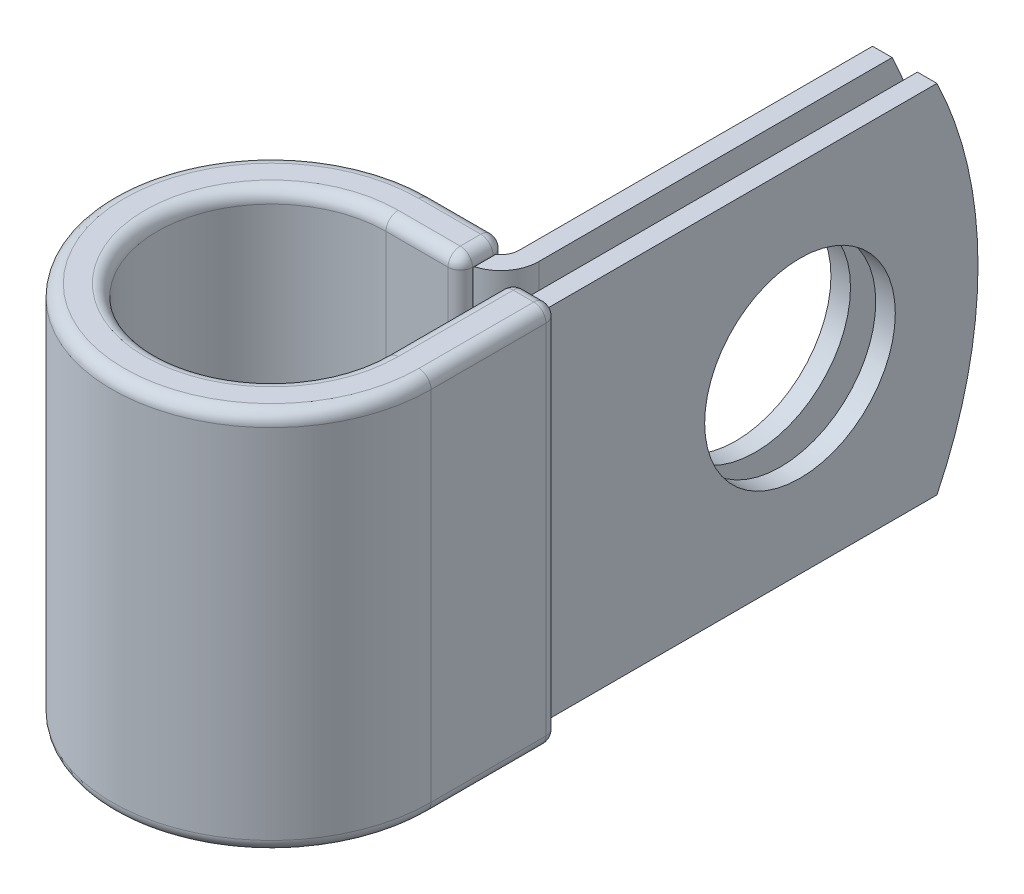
ISO-10303-21;
HEADER;
FILE_DESCRIPTION(('STEP AP214'),'2;1');
FILE_NAME('part.step','',(''),(''),'','','');
FILE_SCHEMA(('AUTOMOTIVE_DESIGN { 1 0 10303 214 1 1 1 1 }'));
ENDSEC;
DATA;
#1=APPLICATION_CONTEXT('core data for automotive mechanical design processes');
#2=APPLICATION_PROTOCOL_DEFINITION('international standard','automotive_design',2000,#1);
#3=PRODUCT_CONTEXT('',#1,'mechanical');
#4=PRODUCT('Part','Part','',(#3));
#5=PRODUCT_RELATED_PRODUCT_CATEGORY('part','',(#4));
#6=PRODUCT_DEFINITION_FORMATION('','',#4);
#7=PRODUCT_DEFINITION_CONTEXT('part definition',#1,'design');
#8=PRODUCT_DEFINITION('design','',#6,#7);
#9=PRODUCT_DEFINITION_SHAPE('','',#8);
#10=(LENGTH_UNIT() NAMED_UNIT(*) SI_UNIT(.MILLI.,.METRE.));
#11=(NAMED_UNIT(*) PLANE_ANGLE_UNIT() SI_UNIT($,.RADIAN.));
#12=(NAMED_UNIT(*) SI_UNIT($,.STERADIAN.) SOLID_ANGLE_UNIT());
#13=UNCERTAINTY_MEASURE_WITH_UNIT(LENGTH_MEASURE(1.E-05),#10,'distance_accuracy_value','');
#14=(GEOMETRIC_REPRESENTATION_CONTEXT(3) GLOBAL_UNCERTAINTY_ASSIGNED_CONTEXT((#13)) GLOBAL_UNIT_ASSIGNED_CONTEXT((#10,
#11,#12)) REPRESENTATION_CONTEXT('',''));
#15=CARTESIAN_POINT('',(0.,0.,0.));
#16=DIRECTION('',(0.,0.,1.));
#17=DIRECTION('',(1.,0.,0.));
#18=AXIS2_PLACEMENT_3D('',#15,#16,#17);
#19=CARTESIAN_POINT('',(6.35635,11.1125,-34.8996));
#20=DIRECTION('',(1.,0.,0.));
#21=DIRECTION('',(0.,0.,-1.));
#22=AXIS2_PLACEMENT_3D('',#19,#20,#21);
#23=PLANE('',#22);
#24=CARTESIAN_POINT('',(6.35635,0.,-23.7998));
#25=DIRECTION('',(1.,0.,0.));
#26=DIRECTION('',(0.,0.,-1.));
#27=AXIS2_PLACEMENT_3D('',#24,#25,#26);
#28=CIRCLE('',#27,5.9436);
#29=CARTESIAN_POINT('',(6.35635,0.,-29.7434));
#30=VERTEX_POINT('',#29);
#31=EDGE_CURVE('E410',#30,#30,#28,.F.);
#32=ORIENTED_EDGE('',*,*,#31,.T.);
#33=EDGE_LOOP('',(#32));
#34=FACE_BOUND('',#33,.T.);
#35=DIRECTION('',(0.,0.,1.));
#36=VECTOR('',#35,1.);
#37=CARTESIAN_POINT('',(6.35635,-11.1125,-34.8996));
#38=LINE('',#37,#36);
#39=CARTESIAN_POINT('',(6.35635,-11.1125,-32.3397476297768));
#40=VERTEX_POINT('',#39);
#41=CARTESIAN_POINT('',(6.35635,-11.1125,-10.30859));
#42=VERTEX_POINT('',#41);
#43=EDGE_CURVE('E432',#40,#42,#38,.T.);
#44=ORIENTED_EDGE('',*,*,#43,.F.);
#45=CARTESIAN_POINT('',(6.35635,0.,-9.49960000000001));
#46=DIRECTION('',(1.,0.,0.));
#47=DIRECTION('',(0.,0.,-1.));
#48=AXIS2_PLACEMENT_3D('',#45,#46,#47);
#49=CIRCLE('',#48,25.4);
#50=CARTESIAN_POINT('',(6.35635,11.1125,-32.3397476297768));
#51=VERTEX_POINT('',#50);
#52=EDGE_CURVE('E395',#40,#51,#49,.T.);
#53=ORIENTED_EDGE('',*,*,#52,.T.);
#54=DIRECTION('',(0.,0.,1.));
#55=VECTOR('',#54,1.);
#56=CARTESIAN_POINT('',(6.35635,11.1125,-34.8996));
#57=LINE('',#56,#55);
#58=CARTESIAN_POINT('',(6.35635,11.1125,-10.30859));
#59=VERTEX_POINT('',#58);
#60=EDGE_CURVE('E422',#51,#59,#57,.T.);
#61=ORIENTED_EDGE('',*,*,#60,.T.);
#62=DIRECTION('',(0.,-1.,0.));
#63=VECTOR('',#62,1.);
#64=CARTESIAN_POINT('',(6.35635,11.1125,-10.30859));
#65=LINE('',#64,#63);
#66=EDGE_CURVE('E439',#59,#42,#65,.T.);
#67=ORIENTED_EDGE('',*,*,#66,.T.);
#68=EDGE_LOOP('',(#44,#53,#61,#67));
#69=FACE_BOUND('',#68,.T.);
#70=ADVANCED_FACE('F54',(#34,#69),#23,.T.);
#71=CARTESIAN_POINT('',(5.13715,11.1125,-34.8996));
#72=DIRECTION('',(1.,0.,0.));
#73=DIRECTION('',(0.,0.,-1.));
#74=AXIS2_PLACEMENT_3D('',#71,#72,#73);
#75=PLANE('',#74);
#76=CARTESIAN_POINT('',(5.13715,0.,-23.7998));
#77=DIRECTION('',(-1.,0.,0.));
#78=DIRECTION('',(0.,0.,1.));
#79=AXIS2_PLACEMENT_3D('',#76,#77,#78);
#80=CIRCLE('',#79,5.9436);
#81=CARTESIAN_POINT('',(5.13715,0.,-17.8562));
#82=VERTEX_POINT('',#81);
#83=EDGE_CURVE('E407',#82,#82,#80,.T.);
#84=ORIENTED_EDGE('',*,*,#83,.F.);
#85=EDGE_LOOP('',(#84));
#86=FACE_BOUND('',#85,.T.);
#87=CARTESIAN_POINT('',(5.13715000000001,0.,-9.49960000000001));
#88=DIRECTION('',(-1.,0.,0.));
#89=DIRECTION('',(0.,0.,1.));
#90=AXIS2_PLACEMENT_3D('',#87,#88,#89);
#91=CIRCLE('',#90,25.4);
#92=CARTESIAN_POINT('',(5.13715,11.1125,-32.3397476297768));
#93=VERTEX_POINT('',#92);
#94=CARTESIAN_POINT('',(5.13715000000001,-11.1125,-32.3397476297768));
#95=VERTEX_POINT('',#94);
#96=EDGE_CURVE('E387',#93,#95,#91,.T.);
#97=ORIENTED_EDGE('',*,*,#96,.T.);
#98=DIRECTION('',(0.,0.,1.));
#99=VECTOR('',#98,1.);
#100=CARTESIAN_POINT('',(5.13715,-11.1125,-34.8996));
#101=LINE('',#100,#99);
#102=CARTESIAN_POINT('',(5.13715,-11.1125,-10.30859));
#103=VERTEX_POINT('',#102);
#104=EDGE_CURVE('E434',#95,#103,#101,.T.);
#105=ORIENTED_EDGE('',*,*,#104,.T.);
#106=DIRECTION('',(0.,-1.,0.));
#107=VECTOR('',#106,1.);
#108=CARTESIAN_POINT('',(5.13715,11.1125,-10.30859));
#109=LINE('',#108,#107);
#110=CARTESIAN_POINT('',(5.13715,11.1125,-10.30859));
#111=VERTEX_POINT('',#110);
#112=EDGE_CURVE('E427',#111,#103,#109,.T.);
#113=ORIENTED_EDGE('',*,*,#112,.F.);
#114=DIRECTION('',(0.,0.,1.));
#115=VECTOR('',#114,1.);
#116=CARTESIAN_POINT('',(5.13715,11.1125,-34.8996));
#117=LINE('',#116,#115);
#118=EDGE_CURVE('E424',#93,#111,#117,.T.);
#119=ORIENTED_EDGE('',*,*,#118,.F.);
#120=EDGE_LOOP('',(#97,#105,#113,#119));
#121=FACE_BOUND('',#120,.T.);
#122=ADVANCED_FACE('F738',(#86,#121),#75,.F.);
#123=CARTESIAN_POINT('',(0.,-11.1125,0.));
#124=DIRECTION('',(0.,1.,0.));
#125=DIRECTION('',(1.,0.,0.));
#126=AXIS2_PLACEMENT_3D('',#123,#124,#125);
#127=PLANE('',#126);
#128=CARTESIAN_POINT('',(3.97891,-11.1125,-10.30859));
#129=DIRECTION('',(0.,-1.,0.));
#130=DIRECTION('',(0.,0.,1.));
#131=AXIS2_PLACEMENT_3D('',#128,#129,#130);
#132=CIRCLE('',#131,2.37744);
#133=CARTESIAN_POINT('',(4.62915000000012,-11.1125,-8.02179991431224));
#134=VERTEX_POINT('',#133);
#135=EDGE_CURVE('E429',#42,#134,#132,.T.);
#136=ORIENTED_EDGE('',*,*,#135,.T.);
#137=DIRECTION('',(0.,0.,-1.));
#138=VECTOR('',#137,1.);
#139=CARTESIAN_POINT('',(4.62915000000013,-11.1125,-9.15035000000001));
#140=LINE('',#139,#138);
#141=CARTESIAN_POINT('',(4.62915000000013,-11.1125,-9.18209999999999));
#142=VERTEX_POINT('',#141);
#143=EDGE_CURVE('E344',#134,#142,#140,.T.);
#144=ORIENTED_EDGE('',*,*,#143,.T.);
#145=CARTESIAN_POINT('',(3.86715000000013,-11.1125,-9.1821));
#146=DIRECTION('',(0.,1.,0.));
#147=DIRECTION('',(0.,0.,1.));
#148=AXIS2_PLACEMENT_3D('',#145,#146,#147);
#149=CIRCLE('',#148,0.762);
#150=CARTESIAN_POINT('',(4.61278082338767,-11.1125,-9.33919447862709));
#151=VERTEX_POINT('',#150);
#152=EDGE_CURVE('E504',#142,#151,#149,.T.);
#153=ORIENTED_EDGE('',*,*,#152,.T.);
#154=CARTESIAN_POINT('',(3.97891,-11.1125,-10.30859));
#155=DIRECTION('',(0.,1.,0.));
#156=DIRECTION('',(1.,0.,0.));
#157=AXIS2_PLACEMENT_3D('',#154,#155,#156);
#158=CIRCLE('',#157,1.15824);
#159=EDGE_CURVE('E77',#103,#151,#158,.F.);
#160=ORIENTED_EDGE('',*,*,#159,.F.);
#161=ORIENTED_EDGE('',*,*,#104,.F.);
#162=DIRECTION('',(-1.,0.,0.));
#163=VECTOR('',#162,1.);
#164=CARTESIAN_POINT('',(9.15035,-11.1125,-32.3397476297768));
#165=LINE('',#164,#163);
#166=EDGE_CURVE('E448',#40,#95,#165,.T.);
#167=ORIENTED_EDGE('',*,*,#166,.F.);
#168=ORIENTED_EDGE('',*,*,#43,.T.);
#169=EDGE_LOOP('',(#136,#144,#153,#160,#161,#167,#168));
#170=FACE_BOUND('',#169,.T.);
#171=ADVANCED_FACE('F744',(#170),#127,.F.);
#172=CARTESIAN_POINT('',(0.,11.1125,0.));
#173=DIRECTION('',(0.,1.,0.));
#174=DIRECTION('',(1.,0.,0.));
#175=AXIS2_PLACEMENT_3D('',#172,#173,#174);
#176=PLANE('',#175);
#177=DIRECTION('',(0.,0.,-1.));
#178=VECTOR('',#177,1.);
#179=CARTESIAN_POINT('',(4.62915,11.1125,0.));
#180=LINE('',#179,#178);
#181=CARTESIAN_POINT('',(4.62915000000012,11.1125,-8.02179991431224));
#182=VERTEX_POINT('',#181);
#183=CARTESIAN_POINT('',(4.62915000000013,11.1125,-9.18209999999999));
#184=VERTEX_POINT('',#183);
#185=EDGE_CURVE('E381',#182,#184,#180,.T.);
#186=ORIENTED_EDGE('',*,*,#185,.F.);
#187=CARTESIAN_POINT('',(3.97891,11.1125,-10.30859));
#188=DIRECTION('',(0.,-1.,0.));
#189=DIRECTION('',(0.,0.,1.));
#190=AXIS2_PLACEMENT_3D('',#187,#188,#189);
#191=CIRCLE('',#190,2.37744);
#192=EDGE_CURVE('E419',#59,#182,#191,.T.);
#193=ORIENTED_EDGE('',*,*,#192,.F.);
#194=ORIENTED_EDGE('',*,*,#60,.F.);
#195=DIRECTION('',(-1.,0.,0.));
#196=VECTOR('',#195,1.);
#197=CARTESIAN_POINT('',(9.15035,11.1125,-32.3397476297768));
#198=LINE('',#197,#196);
#199=EDGE_CURVE('E445',#51,#93,#198,.T.);
#200=ORIENTED_EDGE('',*,*,#199,.T.);
#201=ORIENTED_EDGE('',*,*,#118,.T.);
#202=CARTESIAN_POINT('',(3.97891,11.1125,-10.30859));
#203=DIRECTION('',(0.,1.,0.));
#204=DIRECTION('',(1.,0.,0.));
#205=AXIS2_PLACEMENT_3D('',#202,#203,#204);
#206=CIRCLE('',#205,1.15824);
#207=CARTESIAN_POINT('',(4.61278082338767,11.1125,-9.33919447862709));
#208=VERTEX_POINT('',#207);
#209=EDGE_CURVE('E70',#111,#208,#206,.F.);
#210=ORIENTED_EDGE('',*,*,#209,.T.);
#211=CARTESIAN_POINT('',(3.86715000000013,11.1125,-9.1821));
#212=DIRECTION('',(0.,1.,0.));
#213=DIRECTION('',(0.,0.,1.));
#214=AXIS2_PLACEMENT_3D('',#211,#212,#213);
#215=CIRCLE('',#214,0.762);
#216=EDGE_CURVE('E12',#208,#184,#215,.F.);
#217=ORIENTED_EDGE('',*,*,#216,.T.);
#218=EDGE_LOOP('',(#186,#193,#194,#200,#201,#210,#217));
#219=FACE_BOUND('',#218,.T.);
#220=ADVANCED_FACE('F752',(#219),#176,.T.);
#221=CARTESIAN_POINT('',(3.97891,11.1125,-10.30859));
#222=DIRECTION('',(0.,-1.,0.));
#223=DIRECTION('',(0.,0.,-1.));
#224=AXIS2_PLACEMENT_3D('',#221,#222,#223);
#225=CYLINDRICAL_SURFACE('',#224,2.37744);
#226=ORIENTED_EDGE('',*,*,#135,.F.);
#227=ORIENTED_EDGE('',*,*,#66,.F.);
#228=ORIENTED_EDGE('',*,*,#192,.T.);
#229=CARTESIAN_POINT('',(3.97891,11.1125,-10.30859));
#230=DIRECTION('',(0.,-1.,0.));
#231=DIRECTION('',(0.,0.,-1.));
#232=AXIS2_PLACEMENT_3D('',#229,#230,#231);
#233=CIRCLE('',#232,2.37744);
#234=CARTESIAN_POINT('',(3.97891,11.1125,-7.93115));
#235=VERTEX_POINT('',#234);
#236=EDGE_CURVE('E378',#235,#182,#233,.F.);
#237=ORIENTED_EDGE('',*,*,#236,.F.);
#238=DIRECTION('',(0.,-1.,0.));
#239=VECTOR('',#238,1.);
#240=CARTESIAN_POINT('',(3.97891,11.1125,-7.93115));
#241=LINE('',#240,#239);
#242=CARTESIAN_POINT('',(3.97891,-11.1125,-7.93115));
#243=VERTEX_POINT('',#242);
#244=EDGE_CURVE('E442',#235,#243,#241,.T.);
#245=ORIENTED_EDGE('',*,*,#244,.T.);
#246=CARTESIAN_POINT('',(3.97891,-11.1125,-10.30859));
#247=DIRECTION('',(0.,1.,0.));
#248=DIRECTION('',(0.,0.,1.));
#249=AXIS2_PLACEMENT_3D('',#246,#247,#248);
#250=CIRCLE('',#249,2.37744);
#251=EDGE_CURVE('E376',#134,#243,#250,.F.);
#252=ORIENTED_EDGE('',*,*,#251,.F.);
#253=EDGE_LOOP('',(#226,#227,#228,#237,#245,#252));
#254=FACE_BOUND('',#253,.T.);
#255=ADVANCED_FACE('F749',(#254),#225,.T.);
#256=CARTESIAN_POINT('',(3.97891,11.1125,-10.30859));
#257=DIRECTION('',(0.,-1.,0.));
#258=DIRECTION('',(0.,0.,-1.));
#259=AXIS2_PLACEMENT_3D('',#256,#257,#258);
#260=CYLINDRICAL_SURFACE('',#259,1.15824);
#261=ORIENTED_EDGE('',*,*,#159,.T.);
#262=DIRECTION('',(0.,1.,0.));
#263=VECTOR('',#262,1.);
#264=CARTESIAN_POINT('',(4.61278082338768,-11.1125,-9.33919447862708));
#265=LINE('',#264,#263);
#266=EDGE_CURVE('E63',#151,#208,#265,.T.);
#267=ORIENTED_EDGE('',*,*,#266,.T.);
#268=ORIENTED_EDGE('',*,*,#209,.F.);
#269=ORIENTED_EDGE('',*,*,#112,.T.);
#270=EDGE_LOOP('',(#261,#267,#268,#269));
#271=FACE_BOUND('',#270,.T.);
#272=ADVANCED_FACE('F751',(#271),#260,.F.);
#273=CARTESIAN_POINT('',(23.1673894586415,0.,-23.7998));
#274=DIRECTION('',(-1.,0.,0.));
#275=DIRECTION('',(0.,0.,1.));
#276=AXIS2_PLACEMENT_3D('',#273,#274,#275);
#277=CYLINDRICAL_SURFACE('',#276,5.9436);
#278=ORIENTED_EDGE('',*,*,#83,.T.);
#279=EDGE_LOOP('',(#278));
#280=FACE_BOUND('',#279,.T.);
#281=ORIENTED_EDGE('',*,*,#31,.F.);
#282=EDGE_LOOP('',(#281));
#283=FACE_BOUND('',#282,.T.);
#284=ADVANCED_FACE('F758',(#280,#283),#277,.F.);
#285=CARTESIAN_POINT('',(9.15035,0.,-9.49960000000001));
#286=DIRECTION('',(-1.,0.,0.));
#287=DIRECTION('',(0.,0.,1.));
#288=AXIS2_PLACEMENT_3D('',#285,#286,#287);
#289=CYLINDRICAL_SURFACE('',#288,25.4);
#290=ORIENTED_EDGE('',*,*,#52,.F.);
#291=ORIENTED_EDGE('',*,*,#166,.T.);
#292=ORIENTED_EDGE('',*,*,#96,.F.);
#293=ORIENTED_EDGE('',*,*,#199,.F.);
#294=EDGE_LOOP('',(#290,#291,#292,#293));
#295=FACE_BOUND('',#294,.T.);
#296=ADVANCED_FACE('F809',(#295),#289,.T.);
#297=CARTESIAN_POINT('',(1.14720938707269E-13,-11.1125,-7.93115));
#298=DIRECTION('',(0.,0.,1.));
#299=DIRECTION('',(1.,0.,0.));
#300=AXIS2_PLACEMENT_3D('',#297,#298,#299);
#301=PLANE('',#300);
#302=DIRECTION('',(1.,0.,0.));
#303=VECTOR('',#302,1.);
#304=CARTESIAN_POINT('',(1.14720938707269E-13,-11.1125,-7.93115));
#305=LINE('',#304,#303);
#306=CARTESIAN_POINT('',(4.62915000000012,-11.1125,-7.93115));
#307=VERTEX_POINT('',#306);
#308=EDGE_CURVE('E351',#243,#307,#305,.T.);
#309=ORIENTED_EDGE('',*,*,#308,.F.);
#310=ORIENTED_EDGE('',*,*,#244,.F.);
#311=DIRECTION('',(1.,0.,0.));
#312=VECTOR('',#311,1.);
#313=CARTESIAN_POINT('',(1.14720938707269E-13,11.1125,-7.93115));
#314=LINE('',#313,#312);
#315=CARTESIAN_POINT('',(4.62915000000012,11.1125,-7.93115));
#316=VERTEX_POINT('',#315);
#317=EDGE_CURVE('E353',#235,#316,#314,.T.);
#318=ORIENTED_EDGE('',*,*,#317,.T.);
#319=DIRECTION('',(0.,-1.,0.));
#320=VECTOR('',#319,1.);
#321=CARTESIAN_POINT('',(4.62915000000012,-11.1125,-7.93115));
#322=LINE('',#321,#320);
#323=EDGE_CURVE('E283',#316,#307,#322,.T.);
#324=ORIENTED_EDGE('',*,*,#323,.T.);
#325=EDGE_LOOP('',(#309,#310,#318,#324));
#326=FACE_BOUND('',#325,.T.);
#327=ADVANCED_FACE('F781',(#326),#301,.F.);
#328=CARTESIAN_POINT('',(4.62915000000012,-11.14425,-7.8994));
#329=DIRECTION('',(1.,0.,0.));
#330=DIRECTION('',(0.,0.,-1.));
#331=AXIS2_PLACEMENT_3D('',#328,#329,#330);
#332=PLANE('',#331);
#333=DIRECTION('',(0.,0.,-1.));
#334=VECTOR('',#333,1.);
#335=CARTESIAN_POINT('',(4.62915000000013,-11.14425,-9.1821));
#336=LINE('',#335,#334);
#337=CARTESIAN_POINT('',(4.62915000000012,-11.14425,-7.89939999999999));
#338=VERTEX_POINT('',#337);
#339=CARTESIAN_POINT('',(4.62915000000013,-11.14425,-9.18209999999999));
#340=VERTEX_POINT('',#339);
#341=EDGE_CURVE('E458',#338,#340,#336,.T.);
#342=ORIENTED_EDGE('',*,*,#341,.T.);
#343=DIRECTION('',(0.,1.,0.));
#344=VECTOR('',#343,1.);
#345=CARTESIAN_POINT('',(4.62915000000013,-11.14425,-9.18209999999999));
#346=LINE('',#345,#344);
#347=EDGE_CURVE('E462',#340,#142,#346,.T.);
#348=ORIENTED_EDGE('',*,*,#347,.T.);
#349=ORIENTED_EDGE('',*,*,#143,.F.);
#350=EDGE_CURVE('E345',#307,#134,#140,.T.);
#351=ORIENTED_EDGE('',*,*,#350,.F.);
#352=ORIENTED_EDGE('',*,*,#323,.F.);
#353=DIRECTION('',(0.,0.,1.));
#354=VECTOR('',#353,1.);
#355=CARTESIAN_POINT('',(4.62915000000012,11.1125,-7.93115));
#356=LINE('',#355,#354);
#357=EDGE_CURVE('E348',#182,#316,#356,.T.);
#358=ORIENTED_EDGE('',*,*,#357,.F.);
#359=ORIENTED_EDGE('',*,*,#185,.T.);
#360=DIRECTION('',(0.,1.,0.));
#361=VECTOR('',#360,1.);
#362=CARTESIAN_POINT('',(4.62915000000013,-11.14425,-9.18209999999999));
#363=LINE('',#362,#361);
#364=CARTESIAN_POINT('',(4.62915000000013,11.14425,-9.18209999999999));
#365=VERTEX_POINT('',#364);
#366=EDGE_CURVE('E460',#184,#365,#363,.T.);
#367=ORIENTED_EDGE('',*,*,#366,.T.);
#368=DIRECTION('',(0.,0.,1.));
#369=VECTOR('',#368,1.);
#370=CARTESIAN_POINT('',(4.62915000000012,11.14425,-7.8994));
#371=LINE('',#370,#369);
#372=CARTESIAN_POINT('',(4.62915000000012,11.14425,-7.89939999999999));
#373=VERTEX_POINT('',#372);
#374=EDGE_CURVE('E454',#365,#373,#371,.T.);
#375=ORIENTED_EDGE('',*,*,#374,.T.);
#376=DIRECTION('',(0.,-1.,0.));
#377=VECTOR('',#376,1.);
#378=CARTESIAN_POINT('',(4.62915000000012,-11.14425,-7.89939999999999));
#379=LINE('',#378,#377);
#380=EDGE_CURVE('E456',#373,#338,#379,.T.);
#381=ORIENTED_EDGE('',*,*,#380,.T.);
#382=EDGE_LOOP('',(#342,#348,#349,#351,#352,#358,#359,#367,#375,#381));
#383=FACE_BOUND('',#382,.T.);
#384=ADVANCED_FACE('F777',(#383),#332,.T.);
#385=CARTESIAN_POINT('',(1.32268211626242E-13,-11.14425,-9.1821));
#386=DIRECTION('',(1.,0.,0.));
#387=DIRECTION('',(0.,0.,-1.));
#388=AXIS2_PLACEMENT_3D('',#385,#386,#387);
#389=CYLINDRICAL_SURFACE('',#388,0.762000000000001);
#390=DIRECTION('',(1.,0.,0.));
#391=VECTOR('',#390,1.);
#392=CARTESIAN_POINT('',(1.42956905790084E-13,-11.14425,-9.9441));
#393=LINE('',#392,#391);
#394=CARTESIAN_POINT('',(1.42956905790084E-13,-11.14425,-9.9441));
#395=VERTEX_POINT('',#394);
#396=CARTESIAN_POINT('',(3.86715000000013,-11.14425,-9.9441));
#397=VERTEX_POINT('',#396);
#398=EDGE_CURVE('E370',#395,#397,#393,.T.);
#399=ORIENTED_EDGE('',*,*,#398,.T.);
#400=CARTESIAN_POINT('',(3.86715000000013,-11.14425,-9.1821));
#401=DIRECTION('',(1.,0.,0.));
#402=DIRECTION('',(0.,0.,-1.));
#403=AXIS2_PLACEMENT_3D('',#400,#401,#402);
#404=CIRCLE('',#403,0.762000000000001);
#405=CARTESIAN_POINT('',(3.86715000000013,-11.90625,-9.1821));
#406=VERTEX_POINT('',#405);
#407=EDGE_CURVE('E467',#397,#406,#404,.F.);
#408=ORIENTED_EDGE('',*,*,#407,.T.);
#409=DIRECTION('',(1.,0.,0.));
#410=VECTOR('',#409,1.);
#411=CARTESIAN_POINT('',(1.32268211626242E-13,-11.90625,-9.1821));
#412=LINE('',#411,#410);
#413=CARTESIAN_POINT('',(1.32268211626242E-13,-11.90625,-9.1821));
#414=VERTEX_POINT('',#413);
#415=EDGE_CURVE('E373',#414,#406,#412,.T.);
#416=ORIENTED_EDGE('',*,*,#415,.F.);
#417=CARTESIAN_POINT('',(1.32268211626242E-13,-11.14425,-9.1821));
#418=DIRECTION('',(1.,0.,0.));
#419=DIRECTION('',(0.,0.,1.));
#420=AXIS2_PLACEMENT_3D('',#417,#418,#419);
#421=CIRCLE('',#420,0.762000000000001);
#422=EDGE_CURVE('E321',#414,#395,#421,.T.);
#423=ORIENTED_EDGE('',*,*,#422,.T.);
#424=EDGE_LOOP('',(#399,#408,#416,#423));
#425=FACE_BOUND('',#424,.T.);
#426=ADVANCED_FACE('F620',(#425),#389,.T.);
#427=CARTESIAN_POINT('',(1.42956905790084E-13,11.14425,-9.9441));
#428=DIRECTION('',(0.,0.,-1.));
#429=DIRECTION('',(-1.,0.,0.));
#430=AXIS2_PLACEMENT_3D('',#427,#428,#429);
#431=PLANE('',#430);
#432=DIRECTION('',(1.,0.,0.));
#433=VECTOR('',#432,1.);
#434=CARTESIAN_POINT('',(1.42956905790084E-13,11.14425,-9.9441));
#435=LINE('',#434,#433);
#436=CARTESIAN_POINT('',(1.42956905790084E-13,11.14425,-9.9441));
#437=VERTEX_POINT('',#436);
#438=CARTESIAN_POINT('',(3.86715000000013,11.14425,-9.9441));
#439=VERTEX_POINT('',#438);
#440=EDGE_CURVE('E367',#437,#439,#435,.T.);
#441=ORIENTED_EDGE('',*,*,#440,.T.);
#442=DIRECTION('',(0.,1.,0.));
#443=VECTOR('',#442,1.);
#444=CARTESIAN_POINT('',(3.86715000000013,11.14425,-9.9441));
#445=LINE('',#444,#443);
#446=EDGE_CURVE('E465',#439,#397,#445,.F.);
#447=ORIENTED_EDGE('',*,*,#446,.T.);
#448=ORIENTED_EDGE('',*,*,#398,.F.);
#449=DIRECTION('',(0.,1.,0.));
#450=VECTOR('',#449,1.);
#451=CARTESIAN_POINT('',(1.42956905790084E-13,11.14425,-9.9441));
#452=LINE('',#451,#450);
#453=EDGE_CURVE('E318',#395,#437,#452,.T.);
#454=ORIENTED_EDGE('',*,*,#453,.T.);
#455=EDGE_LOOP('',(#441,#447,#448,#454));
#456=FACE_BOUND('',#455,.T.);
#457=ADVANCED_FACE('F626',(#456),#431,.T.);
#458=CARTESIAN_POINT('',(1.32268211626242E-13,11.14425,-9.1821));
#459=DIRECTION('',(1.,0.,0.));
#460=DIRECTION('',(0.,0.,-1.));
#461=AXIS2_PLACEMENT_3D('',#458,#459,#460);
#462=CYLINDRICAL_SURFACE('',#461,0.762000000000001);
#463=DIRECTION('',(1.,0.,0.));
#464=VECTOR('',#463,1.);
#465=CARTESIAN_POINT('',(1.32268211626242E-13,11.90625,-9.1821));
#466=LINE('',#465,#464);
#467=CARTESIAN_POINT('',(1.32268211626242E-13,11.90625,-9.1821));
#468=VERTEX_POINT('',#467);
#469=CARTESIAN_POINT('',(3.86715000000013,11.90625,-9.1821));
#470=VERTEX_POINT('',#469);
#471=EDGE_CURVE('E364',#468,#470,#466,.T.);
#472=ORIENTED_EDGE('',*,*,#471,.T.);
#473=CARTESIAN_POINT('',(3.86715000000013,11.14425,-9.1821));
#474=DIRECTION('',(1.,0.,0.));
#475=DIRECTION('',(0.,0.,-1.));
#476=AXIS2_PLACEMENT_3D('',#473,#474,#475);
#477=CIRCLE('',#476,0.762000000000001);
#478=EDGE_CURVE('E451',#470,#439,#477,.F.);
#479=ORIENTED_EDGE('',*,*,#478,.T.);
#480=ORIENTED_EDGE('',*,*,#440,.F.);
#481=CARTESIAN_POINT('',(1.32268211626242E-13,11.14425,-9.1821));
#482=DIRECTION('',(1.,0.,0.));
#483=DIRECTION('',(0.,0.,1.));
#484=AXIS2_PLACEMENT_3D('',#481,#482,#483);
#485=CIRCLE('',#484,0.762000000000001);
#486=EDGE_CURVE('E315',#437,#468,#485,.T.);
#487=ORIENTED_EDGE('',*,*,#486,.T.);
#488=EDGE_LOOP('',(#472,#479,#480,#487));
#489=FACE_BOUND('',#488,.T.);
#490=ADVANCED_FACE('F630',(#489),#462,.T.);
#491=CARTESIAN_POINT('',(1.14275576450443E-13,11.14425,-7.8994));
#492=DIRECTION('',(1.,0.,0.));
#493=DIRECTION('',(0.,0.,-1.));
#494=AXIS2_PLACEMENT_3D('',#491,#492,#493);
#495=CYLINDRICAL_SURFACE('',#494,0.762);
#496=DIRECTION('',(1.,0.,0.));
#497=VECTOR('',#496,1.);
#498=CARTESIAN_POINT('',(1.03586882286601E-13,11.14425,-7.1374));
#499=LINE('',#498,#497);
#500=CARTESIAN_POINT('',(1.03586882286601E-13,11.14425,-7.1374));
#501=VERTEX_POINT('',#500);
#502=CARTESIAN_POINT('',(3.86715000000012,11.14425,-7.1374));
#503=VERTEX_POINT('',#502);
#504=EDGE_CURVE('E358',#501,#503,#499,.T.);
#505=ORIENTED_EDGE('',*,*,#504,.T.);
#506=CARTESIAN_POINT('',(3.86715000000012,11.14425,-7.8994));
#507=DIRECTION('',(1.,0.,0.));
#508=DIRECTION('',(0.,0.,-1.));
#509=AXIS2_PLACEMENT_3D('',#506,#507,#508);
#510=CIRCLE('',#509,0.762);
#511=CARTESIAN_POINT('',(3.86715000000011,11.90625,-7.8994));
#512=VERTEX_POINT('',#511);
#513=EDGE_CURVE('E477',#503,#512,#510,.F.);
#514=ORIENTED_EDGE('',*,*,#513,.T.);
#515=DIRECTION('',(1.,0.,0.));
#516=VECTOR('',#515,1.);
#517=CARTESIAN_POINT('',(1.14275576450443E-13,11.90625,-7.8994));
#518=LINE('',#517,#516);
#519=CARTESIAN_POINT('',(1.14275576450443E-13,11.90625,-7.8994));
#520=VERTEX_POINT('',#519);
#521=EDGE_CURVE('E361',#520,#512,#518,.T.);
#522=ORIENTED_EDGE('',*,*,#521,.F.);
#523=CARTESIAN_POINT('',(1.14275576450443E-13,11.14425,-7.8994));
#524=DIRECTION('',(1.,0.,0.));
#525=DIRECTION('',(0.,0.,1.));
#526=AXIS2_PLACEMENT_3D('',#523,#524,#525);
#527=CIRCLE('',#526,0.762);
#528=EDGE_CURVE('E312',#520,#501,#527,.T.);
#529=ORIENTED_EDGE('',*,*,#528,.T.);
#530=EDGE_LOOP('',(#505,#514,#522,#529));
#531=FACE_BOUND('',#530,.T.);
#532=ADVANCED_FACE('F671',(#531),#495,.T.);
#533=CARTESIAN_POINT('',(1.03586882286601E-13,-11.14425,-7.1374));
#534=DIRECTION('',(0.,0.,1.));
#535=DIRECTION('',(1.,0.,0.));
#536=AXIS2_PLACEMENT_3D('',#533,#534,#535);
#537=PLANE('',#536);
#538=DIRECTION('',(1.,0.,0.));
#539=VECTOR('',#538,1.);
#540=CARTESIAN_POINT('',(1.03586882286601E-13,-11.14425,-7.1374));
#541=LINE('',#540,#539);
#542=CARTESIAN_POINT('',(1.03586882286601E-13,-11.14425,-7.1374));
#543=VERTEX_POINT('',#542);
#544=CARTESIAN_POINT('',(3.86715000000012,-11.14425,-7.1374));
#545=VERTEX_POINT('',#544);
#546=EDGE_CURVE('E355',#543,#545,#541,.T.);
#547=ORIENTED_EDGE('',*,*,#546,.T.);
#548=DIRECTION('',(0.,-1.,0.));
#549=VECTOR('',#548,1.);
#550=CARTESIAN_POINT('',(3.86715000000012,-11.14425,-7.1374));
#551=LINE('',#550,#549);
#552=EDGE_CURVE('E475',#545,#503,#551,.F.);
#553=ORIENTED_EDGE('',*,*,#552,.T.);
#554=ORIENTED_EDGE('',*,*,#504,.F.);
#555=DIRECTION('',(0.,-1.,0.));
#556=VECTOR('',#555,1.);
#557=CARTESIAN_POINT('',(1.03586882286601E-13,-11.14425,-7.1374));
#558=LINE('',#557,#556);
#559=EDGE_CURVE('E303',#501,#543,#558,.T.);
#560=ORIENTED_EDGE('',*,*,#559,.T.);
#561=EDGE_LOOP('',(#547,#553,#554,#560));
#562=FACE_BOUND('',#561,.T.);
#563=ADVANCED_FACE('F669',(#562),#537,.T.);
#564=CARTESIAN_POINT('',(1.14275576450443E-13,-11.14425,-7.8994));
#565=DIRECTION('',(1.,0.,0.));
#566=DIRECTION('',(0.,0.,-1.));
#567=AXIS2_PLACEMENT_3D('',#564,#565,#566);
#568=CYLINDRICAL_SURFACE('',#567,0.762);
#569=DIRECTION('',(1.,0.,0.));
#570=VECTOR('',#569,1.);
#571=CARTESIAN_POINT('',(1.14275576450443E-13,-11.90625,-7.8994));
#572=LINE('',#571,#570);
#573=CARTESIAN_POINT('',(1.14275576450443E-13,-11.90625,-7.8994));
#574=VERTEX_POINT('',#573);
#575=CARTESIAN_POINT('',(3.86715000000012,-11.90625,-7.8994));
#576=VERTEX_POINT('',#575);
#577=EDGE_CURVE('E279',#574,#576,#572,.T.);
#578=ORIENTED_EDGE('',*,*,#577,.T.);
#579=CARTESIAN_POINT('',(3.86715000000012,-11.14425,-7.8994));
#580=DIRECTION('',(1.,0.,0.));
#581=DIRECTION('',(0.,0.,-1.));
#582=AXIS2_PLACEMENT_3D('',#579,#580,#581);
#583=CIRCLE('',#582,0.762);
#584=EDGE_CURVE('E473',#576,#545,#583,.F.);
#585=ORIENTED_EDGE('',*,*,#584,.T.);
#586=ORIENTED_EDGE('',*,*,#546,.F.);
#587=CARTESIAN_POINT('',(1.14275576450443E-13,-11.14425,-7.8994));
#588=DIRECTION('',(1.,0.,0.));
#589=DIRECTION('',(0.,0.,-1.));
#590=AXIS2_PLACEMENT_3D('',#587,#588,#589);
#591=CIRCLE('',#590,0.762);
#592=EDGE_CURVE('E300',#543,#574,#591,.T.);
#593=ORIENTED_EDGE('',*,*,#592,.T.);
#594=EDGE_LOOP('',(#578,#585,#586,#593));
#595=FACE_BOUND('',#594,.T.);
#596=ADVANCED_FACE('F659',(#595),#568,.T.);
#597=CARTESIAN_POINT('',(0.,-11.14425,0.));
#598=DIRECTION('',(0.,-1.,0.));
#599=DIRECTION('',(0.,0.,-1.));
#600=AXIS2_PLACEMENT_3D('',#597,#598,#599);
#601=TOROIDAL_SURFACE('',#600,9.1821,0.762000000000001);
#602=CARTESIAN_POINT('',(9.1821,-11.14425,0.));
#603=DIRECTION('',(0.,0.,1.));
#604=DIRECTION('',(-1.,0.,0.));
#605=AXIS2_PLACEMENT_3D('',#602,#603,#604);
#606=CIRCLE('',#605,0.762000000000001);
#607=CARTESIAN_POINT('',(9.1821,-11.90625,0.));
#608=VERTEX_POINT('',#607);
#609=CARTESIAN_POINT('',(9.9441,-11.14425,0.));
#610=VERTEX_POINT('',#609);
#611=EDGE_CURVE('E294',#608,#610,#606,.T.);
#612=ORIENTED_EDGE('',*,*,#611,.T.);
#613=CARTESIAN_POINT('',(0.,-11.14425,0.));
#614=DIRECTION('',(0.,-1.,0.));
#615=DIRECTION('',(0.,0.,-1.));
#616=AXIS2_PLACEMENT_3D('',#613,#614,#615);
#617=CIRCLE('',#616,9.9441);
#618=EDGE_CURVE('E337',#610,#395,#617,.T.);
#619=ORIENTED_EDGE('',*,*,#618,.T.);
#620=ORIENTED_EDGE('',*,*,#422,.F.);
#621=CARTESIAN_POINT('',(0.,-11.90625,0.));
#622=DIRECTION('',(0.,-1.,0.));
#623=DIRECTION('',(0.,0.,-1.));
#624=AXIS2_PLACEMENT_3D('',#621,#622,#623);
#625=CIRCLE('',#624,9.1821);
#626=EDGE_CURVE('E284',#608,#414,#625,.T.);
#627=ORIENTED_EDGE('',*,*,#626,.F.);
#628=EDGE_LOOP('',(#612,#619,#620,#627));
#629=FACE_BOUND('',#628,.T.);
#630=ADVANCED_FACE('F617',(#629),#601,.T.);
#631=CARTESIAN_POINT('',(0.,11.1125,0.));
#632=DIRECTION('',(0.,-1.,0.));
#633=DIRECTION('',(0.,0.,-1.));
#634=AXIS2_PLACEMENT_3D('',#631,#632,#633);
#635=CYLINDRICAL_SURFACE('',#634,9.9441);
#636=DIRECTION('',(0.,1.,0.));
#637=VECTOR('',#636,1.);
#638=CARTESIAN_POINT('',(9.9441,11.14425,0.));
#639=LINE('',#638,#637);
#640=CARTESIAN_POINT('',(9.9441,11.14425,0.));
#641=VERTEX_POINT('',#640);
#642=EDGE_CURVE('E605',#610,#641,#639,.T.);
#643=ORIENTED_EDGE('',*,*,#642,.T.);
#644=CARTESIAN_POINT('',(0.,11.14425,0.));
#645=DIRECTION('',(0.,-1.,0.));
#646=DIRECTION('',(0.,0.,-1.));
#647=AXIS2_PLACEMENT_3D('',#644,#645,#646);
#648=CIRCLE('',#647,9.9441);
#649=EDGE_CURVE('E334',#641,#437,#648,.T.);
#650=ORIENTED_EDGE('',*,*,#649,.T.);
#651=ORIENTED_EDGE('',*,*,#453,.F.);
#652=ORIENTED_EDGE('',*,*,#618,.F.);
#653=EDGE_LOOP('',(#643,#650,#651,#652));
#654=FACE_BOUND('',#653,.T.);
#655=ADVANCED_FACE('F623',(#654),#635,.T.);
#656=CARTESIAN_POINT('',(0.,11.14425,0.));
#657=DIRECTION('',(0.,-1.,0.));
#658=DIRECTION('',(0.,0.,-1.));
#659=AXIS2_PLACEMENT_3D('',#656,#657,#658);
#660=TOROIDAL_SURFACE('',#659,9.1821,0.762000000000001);
#661=CARTESIAN_POINT('',(9.1821,11.14425,0.));
#662=DIRECTION('',(0.,0.,1.));
#663=DIRECTION('',(-1.,0.,0.));
#664=AXIS2_PLACEMENT_3D('',#661,#662,#663);
#665=CIRCLE('',#664,0.762000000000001);
#666=CARTESIAN_POINT('',(9.1821,11.90625,0.));
#667=VERTEX_POINT('',#666);
#668=EDGE_CURVE('E684',#641,#667,#665,.T.);
#669=ORIENTED_EDGE('',*,*,#668,.T.);
#670=CARTESIAN_POINT('',(0.,11.90625,0.));
#671=DIRECTION('',(0.,-1.,0.));
#672=DIRECTION('',(0.,0.,-1.));
#673=AXIS2_PLACEMENT_3D('',#670,#671,#672);
#674=CIRCLE('',#673,9.1821);
#675=EDGE_CURVE('E331',#667,#468,#674,.T.);
#676=ORIENTED_EDGE('',*,*,#675,.T.);
#677=ORIENTED_EDGE('',*,*,#486,.F.);
#678=ORIENTED_EDGE('',*,*,#649,.F.);
#679=EDGE_LOOP('',(#669,#676,#677,#678));
#680=FACE_BOUND('',#679,.T.);
#681=ADVANCED_FACE('F628',(#680),#660,.T.);
#682=CARTESIAN_POINT('',(0.,11.14425,0.));
#683=DIRECTION('',(0.,-1.,0.));
#684=DIRECTION('',(0.,0.,-1.));
#685=AXIS2_PLACEMENT_3D('',#682,#683,#684);
#686=TOROIDAL_SURFACE('',#685,7.8994,0.762);
#687=CARTESIAN_POINT('',(7.8994,11.14425,0.));
#688=DIRECTION('',(0.,0.,1.));
#689=DIRECTION('',(-1.,0.,0.));
#690=AXIS2_PLACEMENT_3D('',#687,#688,#689);
#691=CIRCLE('',#690,0.762);
#692=CARTESIAN_POINT('',(7.8994,11.90625,0.));
#693=VERTEX_POINT('',#692);
#694=CARTESIAN_POINT('',(7.1374,11.14425,0.));
#695=VERTEX_POINT('',#694);
#696=EDGE_CURVE('E680',#693,#695,#691,.T.);
#697=ORIENTED_EDGE('',*,*,#696,.T.);
#698=CARTESIAN_POINT('',(0.,11.14425,0.));
#699=DIRECTION('',(0.,-1.,0.));
#700=DIRECTION('',(0.,0.,-1.));
#701=AXIS2_PLACEMENT_3D('',#698,#699,#700);
#702=CIRCLE('',#701,7.1374);
#703=EDGE_CURVE('E325',#695,#501,#702,.T.);
#704=ORIENTED_EDGE('',*,*,#703,.T.);
#705=ORIENTED_EDGE('',*,*,#528,.F.);
#706=CARTESIAN_POINT('',(0.,11.90625,0.));
#707=DIRECTION('',(0.,-1.,0.));
#708=DIRECTION('',(0.,0.,-1.));
#709=AXIS2_PLACEMENT_3D('',#706,#707,#708);
#710=CIRCLE('',#709,7.8994);
#711=EDGE_CURVE('E328',#693,#520,#710,.T.);
#712=ORIENTED_EDGE('',*,*,#711,.F.);
#713=EDGE_LOOP('',(#697,#704,#705,#712));
#714=FACE_BOUND('',#713,.T.);
#715=ADVANCED_FACE('F678',(#714),#686,.T.);
#716=CARTESIAN_POINT('',(0.,11.1125,0.));
#717=DIRECTION('',(0.,-1.,0.));
#718=DIRECTION('',(0.,0.,-1.));
#719=AXIS2_PLACEMENT_3D('',#716,#717,#718);
#720=CYLINDRICAL_SURFACE('',#719,7.1374);
#721=DIRECTION('',(0.,-1.,0.));
#722=VECTOR('',#721,1.);
#723=CARTESIAN_POINT('',(7.1374,-11.14425,0.));
#724=LINE('',#723,#722);
#725=CARTESIAN_POINT('',(7.1374,-11.14425,0.));
#726=VERTEX_POINT('',#725);
#727=EDGE_CURVE('E683',#695,#726,#724,.T.);
#728=ORIENTED_EDGE('',*,*,#727,.T.);
#729=CARTESIAN_POINT('',(0.,-11.14425,0.));
#730=DIRECTION('',(0.,-1.,0.));
#731=DIRECTION('',(0.,0.,-1.));
#732=AXIS2_PLACEMENT_3D('',#729,#730,#731);
#733=CIRCLE('',#732,7.1374);
#734=EDGE_CURVE('E290',#726,#543,#733,.T.);
#735=ORIENTED_EDGE('',*,*,#734,.T.);
#736=ORIENTED_EDGE('',*,*,#559,.F.);
#737=ORIENTED_EDGE('',*,*,#703,.F.);
#738=EDGE_LOOP('',(#728,#735,#736,#737));
#739=FACE_BOUND('',#738,.T.);
#740=ADVANCED_FACE('F676',(#739),#720,.F.);
#741=CARTESIAN_POINT('',(0.,-11.14425,0.));
#742=DIRECTION('',(0.,-1.,0.));
#743=DIRECTION('',(0.,0.,-1.));
#744=AXIS2_PLACEMENT_3D('',#741,#742,#743);
#745=TOROIDAL_SURFACE('',#744,7.8994,0.762);
#746=CARTESIAN_POINT('',(7.8994,-11.14425,0.));
#747=DIRECTION('',(0.,0.,1.));
#748=DIRECTION('',(1.,0.,0.));
#749=AXIS2_PLACEMENT_3D('',#746,#747,#748);
#750=CIRCLE('',#749,0.762);
#751=CARTESIAN_POINT('',(7.8994,-11.90625,0.));
#752=VERTEX_POINT('',#751);
#753=EDGE_CURVE('E287',#726,#752,#750,.T.);
#754=ORIENTED_EDGE('',*,*,#753,.T.);
#755=CARTESIAN_POINT('',(0.,-11.90625,0.));
#756=DIRECTION('',(0.,-1.,0.));
#757=DIRECTION('',(0.,0.,-1.));
#758=AXIS2_PLACEMENT_3D('',#755,#756,#757);
#759=CIRCLE('',#758,7.8994);
#760=EDGE_CURVE('E271',#752,#574,#759,.T.);
#761=ORIENTED_EDGE('',*,*,#760,.T.);
#762=ORIENTED_EDGE('',*,*,#592,.F.);
#763=ORIENTED_EDGE('',*,*,#734,.F.);
#764=EDGE_LOOP('',(#754,#761,#762,#763));
#765=FACE_BOUND('',#764,.T.);
#766=ADVANCED_FACE('F288',(#765),#745,.T.);
#767=CARTESIAN_POINT('',(7.8994,-11.14425,0.));
#768=DIRECTION('',(0.,0.,-1.));
#769=DIRECTION('',(-1.,0.,0.));
#770=AXIS2_PLACEMENT_3D('',#767,#768,#769);
#771=CYLINDRICAL_SURFACE('',#770,0.762);
#772=DIRECTION('',(0.,0.,-1.));
#773=VECTOR('',#772,1.);
#774=CARTESIAN_POINT('',(7.1374,-11.14425,0.));
#775=LINE('',#774,#773);
#776=CARTESIAN_POINT('',(7.1374,-11.14425,-7.16915));
#777=VERTEX_POINT('',#776);
#778=EDGE_CURVE('E691',#726,#777,#775,.T.);
#779=ORIENTED_EDGE('',*,*,#778,.T.);
#780=CARTESIAN_POINT('',(7.8994,-11.14425,-7.16915));
#781=DIRECTION('',(0.,0.,-1.));
#782=DIRECTION('',(-1.,0.,0.));
#783=AXIS2_PLACEMENT_3D('',#780,#781,#782);
#784=CIRCLE('',#783,0.762);
#785=CARTESIAN_POINT('',(7.8994,-11.90625,-7.16915));
#786=VERTEX_POINT('',#785);
#787=EDGE_CURVE('E299',#777,#786,#784,.F.);
#788=ORIENTED_EDGE('',*,*,#787,.T.);
#789=DIRECTION('',(0.,0.,-1.));
#790=VECTOR('',#789,1.);
#791=CARTESIAN_POINT('',(7.8994,-11.90625,0.));
#792=LINE('',#791,#790);
#793=EDGE_CURVE('E276',#752,#786,#792,.T.);
#794=ORIENTED_EDGE('',*,*,#793,.F.);
#795=ORIENTED_EDGE('',*,*,#753,.F.);
#796=EDGE_LOOP('',(#779,#788,#794,#795));
#797=FACE_BOUND('',#796,.T.);
#798=ADVANCED_FACE('F297',(#797),#771,.T.);
#799=CARTESIAN_POINT('',(9.1821,-11.90625,0.));
#800=DIRECTION('',(0.,1.,0.));
#801=DIRECTION('',(0.,0.,1.));
#802=AXIS2_PLACEMENT_3D('',#799,#800,#801);
#803=PLANE('',#802);
#804=ORIENTED_EDGE('',*,*,#415,.T.);
#805=DIRECTION('',(0.,0.,-1.));
#806=VECTOR('',#805,1.);
#807=CARTESIAN_POINT('',(3.86715000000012,-11.90625,-7.89940000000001));
#808=LINE('',#807,#806);
#809=EDGE_CURVE('E471',#406,#576,#808,.F.);
#810=ORIENTED_EDGE('',*,*,#809,.T.);
#811=ORIENTED_EDGE('',*,*,#577,.F.);
#812=ORIENTED_EDGE('',*,*,#760,.F.);
#813=ORIENTED_EDGE('',*,*,#793,.T.);
#814=DIRECTION('',(1.,0.,0.));
#815=VECTOR('',#814,1.);
#816=CARTESIAN_POINT('',(9.1821,-11.90625,-7.16915));
#817=LINE('',#816,#815);
#818=CARTESIAN_POINT('',(9.1821,-11.90625,-7.16915));
#819=VERTEX_POINT('',#818);
#820=EDGE_CURVE('E469',#786,#819,#817,.T.);
#821=ORIENTED_EDGE('',*,*,#820,.T.);
#822=DIRECTION('',(0.,0.,-1.));
#823=VECTOR('',#822,1.);
#824=CARTESIAN_POINT('',(9.1821,-11.90625,0.));
#825=LINE('',#824,#823);
#826=EDGE_CURVE('E301',#608,#819,#825,.T.);
#827=ORIENTED_EDGE('',*,*,#826,.F.);
#828=ORIENTED_EDGE('',*,*,#626,.T.);
#829=EDGE_LOOP('',(#804,#810,#811,#812,#813,#821,#827,#828));
#830=FACE_BOUND('',#829,.T.);
#831=ADVANCED_FACE('F274',(#830),#803,.F.);
#832=CARTESIAN_POINT('',(9.1821,-11.14425,0.));
#833=DIRECTION('',(0.,0.,-1.));
#834=DIRECTION('',(-1.,0.,0.));
#835=AXIS2_PLACEMENT_3D('',#832,#833,#834);
#836=CYLINDRICAL_SURFACE('',#835,0.762000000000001);
#837=ORIENTED_EDGE('',*,*,#826,.T.);
#838=CARTESIAN_POINT('',(9.1821,-11.14425,-7.16915));
#839=DIRECTION('',(0.,0.,-1.));
#840=DIRECTION('',(-1.,0.,0.));
#841=AXIS2_PLACEMENT_3D('',#838,#839,#840);
#842=CIRCLE('',#841,0.762000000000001);
#843=CARTESIAN_POINT('',(9.9441,-11.14425,-7.16915));
#844=VERTEX_POINT('',#843);
#845=EDGE_CURVE('E493',#819,#844,#842,.F.);
#846=ORIENTED_EDGE('',*,*,#845,.T.);
#847=DIRECTION('',(0.,0.,-1.));
#848=VECTOR('',#847,1.);
#849=CARTESIAN_POINT('',(9.9441,-11.14425,0.));
#850=LINE('',#849,#848);
#851=EDGE_CURVE('E306',#610,#844,#850,.T.);
#852=ORIENTED_EDGE('',*,*,#851,.F.);
#853=ORIENTED_EDGE('',*,*,#611,.F.);
#854=EDGE_LOOP('',(#837,#846,#852,#853));
#855=FACE_BOUND('',#854,.T.);
#856=ADVANCED_FACE('F611',(#855),#836,.T.);
#857=CARTESIAN_POINT('',(9.9441,11.14425,0.));
#858=DIRECTION('',(-1.,0.,0.));
#859=DIRECTION('',(0.,-1.,0.));
#860=AXIS2_PLACEMENT_3D('',#857,#858,#859);
#861=PLANE('',#860);
#862=ORIENTED_EDGE('',*,*,#851,.T.);
#863=DIRECTION('',(0.,1.,0.));
#864=VECTOR('',#863,1.);
#865=CARTESIAN_POINT('',(9.9441,11.14425,-7.16915));
#866=LINE('',#865,#864);
#867=CARTESIAN_POINT('',(9.9441,11.14425,-7.16915));
#868=VERTEX_POINT('',#867);
#869=EDGE_CURVE('E482',#844,#868,#866,.T.);
#870=ORIENTED_EDGE('',*,*,#869,.T.);
#871=DIRECTION('',(0.,0.,-1.));
#872=VECTOR('',#871,1.);
#873=CARTESIAN_POINT('',(9.9441,11.14425,0.));
#874=LINE('',#873,#872);
#875=EDGE_CURVE('E590',#641,#868,#874,.T.);
#876=ORIENTED_EDGE('',*,*,#875,.F.);
#877=ORIENTED_EDGE('',*,*,#642,.F.);
#878=EDGE_LOOP('',(#862,#870,#876,#877));
#879=FACE_BOUND('',#878,.T.);
#880=ADVANCED_FACE('F603',(#879),#861,.F.);
#881=CARTESIAN_POINT('',(9.1821,11.14425,0.));
#882=DIRECTION('',(0.,0.,-1.));
#883=DIRECTION('',(-1.,0.,0.));
#884=AXIS2_PLACEMENT_3D('',#881,#882,#883);
#885=CYLINDRICAL_SURFACE('',#884,0.762000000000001);
#886=ORIENTED_EDGE('',*,*,#875,.T.);
#887=CARTESIAN_POINT('',(9.1821,11.14425,-7.16915));
#888=DIRECTION('',(0.,0.,-1.));
#889=DIRECTION('',(-1.,0.,0.));
#890=AXIS2_PLACEMENT_3D('',#887,#888,#889);
#891=CIRCLE('',#890,0.762000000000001);
#892=CARTESIAN_POINT('',(9.1821,11.90625,-7.16915));
#893=VERTEX_POINT('',#892);
#894=EDGE_CURVE('E479',#868,#893,#891,.F.);
#895=ORIENTED_EDGE('',*,*,#894,.T.);
#896=DIRECTION('',(0.,0.,-1.));
#897=VECTOR('',#896,1.);
#898=CARTESIAN_POINT('',(9.1821,11.90625,0.));
#899=LINE('',#898,#897);
#900=EDGE_CURVE('E588',#667,#893,#899,.T.);
#901=ORIENTED_EDGE('',*,*,#900,.F.);
#902=ORIENTED_EDGE('',*,*,#668,.F.);
#903=EDGE_LOOP('',(#886,#895,#901,#902));
#904=FACE_BOUND('',#903,.T.);
#905=ADVANCED_FACE('F586',(#904),#885,.T.);
#906=CARTESIAN_POINT('',(7.8994,11.90625,0.));
#907=DIRECTION('',(0.,-1.,0.));
#908=DIRECTION('',(1.,0.,0.));
#909=AXIS2_PLACEMENT_3D('',#906,#907,#908);
#910=PLANE('',#909);
#911=ORIENTED_EDGE('',*,*,#521,.T.);
#912=DIRECTION('',(0.,0.,1.));
#913=VECTOR('',#912,1.);
#914=CARTESIAN_POINT('',(3.86715000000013,11.90625,-9.18210000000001));
#915=LINE('',#914,#913);
#916=EDGE_CURVE('E502',#512,#470,#915,.F.);
#917=ORIENTED_EDGE('',*,*,#916,.T.);
#918=ORIENTED_EDGE('',*,*,#471,.F.);
#919=ORIENTED_EDGE('',*,*,#675,.F.);
#920=ORIENTED_EDGE('',*,*,#900,.T.);
#921=DIRECTION('',(-1.,0.,0.));
#922=VECTOR('',#921,1.);
#923=CARTESIAN_POINT('',(7.8994,11.90625,-7.16915));
#924=LINE('',#923,#922);
#925=CARTESIAN_POINT('',(7.8994,11.90625,-7.16915));
#926=VERTEX_POINT('',#925);
#927=EDGE_CURVE('E500',#893,#926,#924,.T.);
#928=ORIENTED_EDGE('',*,*,#927,.T.);
#929=DIRECTION('',(0.,0.,-1.));
#930=VECTOR('',#929,1.);
#931=CARTESIAN_POINT('',(7.8994,11.90625,0.));
#932=LINE('',#931,#930);
#933=EDGE_CURVE('E593',#693,#926,#932,.T.);
#934=ORIENTED_EDGE('',*,*,#933,.F.);
#935=ORIENTED_EDGE('',*,*,#711,.T.);
#936=EDGE_LOOP('',(#911,#917,#918,#919,#920,#928,#934,#935));
#937=FACE_BOUND('',#936,.T.);
#938=ADVANCED_FACE('F591',(#937),#910,.F.);
#939=CARTESIAN_POINT('',(7.8994,11.14425,0.));
#940=DIRECTION('',(0.,0.,-1.));
#941=DIRECTION('',(-1.,0.,0.));
#942=AXIS2_PLACEMENT_3D('',#939,#940,#941);
#943=CYLINDRICAL_SURFACE('',#942,0.762);
#944=ORIENTED_EDGE('',*,*,#933,.T.);
#945=CARTESIAN_POINT('',(7.8994,11.14425,-7.16915));
#946=DIRECTION('',(0.,0.,-1.));
#947=DIRECTION('',(-1.,0.,0.));
#948=AXIS2_PLACEMENT_3D('',#945,#946,#947);
#949=CIRCLE('',#948,0.762);
#950=CARTESIAN_POINT('',(7.1374,11.14425,-7.16915));
#951=VERTEX_POINT('',#950);
#952=EDGE_CURVE('E498',#926,#951,#949,.F.);
#953=ORIENTED_EDGE('',*,*,#952,.T.);
#954=DIRECTION('',(0.,0.,-1.));
#955=VECTOR('',#954,1.);
#956=CARTESIAN_POINT('',(7.1374,11.14425,0.));
#957=LINE('',#956,#955);
#958=EDGE_CURVE('E596',#695,#951,#957,.T.);
#959=ORIENTED_EDGE('',*,*,#958,.F.);
#960=ORIENTED_EDGE('',*,*,#696,.F.);
#961=EDGE_LOOP('',(#944,#953,#959,#960));
#962=FACE_BOUND('',#961,.T.);
#963=ADVANCED_FACE('F688',(#962),#943,.T.);
#964=CARTESIAN_POINT('',(7.93115,11.1125,0.));
#965=DIRECTION('',(0.,-1.,0.));
#966=DIRECTION('',(0.,0.,-1.));
#967=AXIS2_PLACEMENT_3D('',#964,#965,#966);
#968=PLANE('',#967);
#969=ORIENTED_EDGE('',*,*,#317,.F.);
#970=ORIENTED_EDGE('',*,*,#236,.T.);
#971=ORIENTED_EDGE('',*,*,#357,.T.);
#972=EDGE_LOOP('',(#969,#970,#971));
#973=FACE_BOUND('',#972,.T.);
#974=ADVANCED_FACE('F775',(#973),#968,.T.);
#975=CARTESIAN_POINT('',(9.15035,-11.1125,0.));
#976=DIRECTION('',(0.,1.,0.));
#977=DIRECTION('',(0.,0.,1.));
#978=AXIS2_PLACEMENT_3D('',#975,#976,#977);
#979=PLANE('',#978);
#980=ORIENTED_EDGE('',*,*,#350,.T.);
#981=ORIENTED_EDGE('',*,*,#251,.T.);
#982=ORIENTED_EDGE('',*,*,#308,.T.);
#983=EDGE_LOOP('',(#980,#981,#982));
#984=FACE_BOUND('',#983,.T.);
#985=ADVANCED_FACE('F783',(#984),#979,.T.);
#986=CARTESIAN_POINT('',(7.1374,-11.14425,0.));
#987=DIRECTION('',(1.,0.,0.));
#988=DIRECTION('',(0.,0.,-1.));
#989=AXIS2_PLACEMENT_3D('',#986,#987,#988);
#990=PLANE('',#989);
#991=ORIENTED_EDGE('',*,*,#958,.T.);
#992=DIRECTION('',(0.,-1.,0.));
#993=VECTOR('',#992,1.);
#994=CARTESIAN_POINT('',(7.1374,-11.14425,-7.16915));
#995=LINE('',#994,#993);
#996=EDGE_CURVE('E496',#951,#777,#995,.T.);
#997=ORIENTED_EDGE('',*,*,#996,.T.);
#998=ORIENTED_EDGE('',*,*,#778,.F.);
#999=ORIENTED_EDGE('',*,*,#727,.F.);
#1000=EDGE_LOOP('',(#991,#997,#998,#999));
#1001=FACE_BOUND('',#1000,.T.);
#1002=ADVANCED_FACE('F693',(#1001),#990,.F.);
#1003=CARTESIAN_POINT('',(7.8994,-11.14425,-7.93115));
#1004=DIRECTION('',(0.,0.,1.));
#1005=DIRECTION('',(1.,0.,0.));
#1006=AXIS2_PLACEMENT_3D('',#1003,#1004,#1005);
#1007=PLANE('',#1006);
#1008=DIRECTION('',(-1.,0.,0.));
#1009=VECTOR('',#1008,1.);
#1010=CARTESIAN_POINT('',(7.89939999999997,11.14425,-7.93115));
#1011=LINE('',#1010,#1009);
#1012=CARTESIAN_POINT('',(7.8994,11.14425,-7.93115));
#1013=VERTEX_POINT('',#1012);
#1014=CARTESIAN_POINT('',(9.1821,11.14425,-7.93115));
#1015=VERTEX_POINT('',#1014);
#1016=EDGE_CURVE('E484',#1013,#1015,#1011,.F.);
#1017=ORIENTED_EDGE('',*,*,#1016,.T.);
#1018=DIRECTION('',(0.,1.,0.));
#1019=VECTOR('',#1018,1.);
#1020=CARTESIAN_POINT('',(9.1821,-11.14425,-7.93115));
#1021=LINE('',#1020,#1019);
#1022=CARTESIAN_POINT('',(9.1821,-11.14425,-7.93115));
#1023=VERTEX_POINT('',#1022);
#1024=EDGE_CURVE('E490',#1015,#1023,#1021,.F.);
#1025=ORIENTED_EDGE('',*,*,#1024,.T.);
#1026=DIRECTION('',(1.,0.,0.));
#1027=VECTOR('',#1026,1.);
#1028=CARTESIAN_POINT('',(7.8994,-11.14425,-7.93115));
#1029=LINE('',#1028,#1027);
#1030=CARTESIAN_POINT('',(7.8994,-11.14425,-7.93115));
#1031=VERTEX_POINT('',#1030);
#1032=EDGE_CURVE('E488',#1023,#1031,#1029,.F.);
#1033=ORIENTED_EDGE('',*,*,#1032,.T.);
#1034=DIRECTION('',(0.,-1.,0.));
#1035=VECTOR('',#1034,1.);
#1036=CARTESIAN_POINT('',(7.8994,-11.14425,-7.93115));
#1037=LINE('',#1036,#1035);
#1038=EDGE_CURVE('E486',#1031,#1013,#1037,.F.);
#1039=ORIENTED_EDGE('',*,*,#1038,.T.);
#1040=EDGE_LOOP('',(#1017,#1025,#1033,#1039));
#1041=FACE_BOUND('',#1040,.T.);
#1042=DIRECTION('',(0.,-1.,0.));
#1043=VECTOR('',#1042,1.);
#1044=CARTESIAN_POINT('',(7.93115,-11.1125,-7.93115));
#1045=LINE('',#1044,#1043);
#1046=CARTESIAN_POINT('',(7.93115,11.1125,-7.93115));
#1047=VERTEX_POINT('',#1046);
#1048=CARTESIAN_POINT('',(7.93115,-11.1125,-7.93115));
#1049=VERTEX_POINT('',#1048);
#1050=EDGE_CURVE('E530',#1047,#1049,#1045,.T.);
#1051=ORIENTED_EDGE('',*,*,#1050,.T.);
#1052=DIRECTION('',(1.,0.,0.));
#1053=VECTOR('',#1052,1.);
#1054=CARTESIAN_POINT('',(9.15035,-11.1125,-7.93115));
#1055=LINE('',#1054,#1053);
#1056=CARTESIAN_POINT('',(9.15035,-11.1125,-7.93115));
#1057=VERTEX_POINT('',#1056);
#1058=EDGE_CURVE('E295',#1049,#1057,#1055,.T.);
#1059=ORIENTED_EDGE('',*,*,#1058,.T.);
#1060=DIRECTION('',(0.,1.,0.));
#1061=VECTOR('',#1060,1.);
#1062=CARTESIAN_POINT('',(9.15035,11.1125,-7.93115));
#1063=LINE('',#1062,#1061);
#1064=CARTESIAN_POINT('',(9.15035,11.1125,-7.93115));
#1065=VERTEX_POINT('',#1064);
#1066=EDGE_CURVE('E701',#1057,#1065,#1063,.T.);
#1067=ORIENTED_EDGE('',*,*,#1066,.T.);
#1068=DIRECTION('',(-1.,0.,0.));
#1069=VECTOR('',#1068,1.);
#1070=CARTESIAN_POINT('',(7.93115,11.1125,-7.93115));
#1071=LINE('',#1070,#1069);
#1072=EDGE_CURVE('E699',#1065,#1047,#1071,.T.);
#1073=ORIENTED_EDGE('',*,*,#1072,.T.);
#1074=EDGE_LOOP('',(#1051,#1059,#1067,#1073));
#1075=FACE_BOUND('',#1074,.T.);
#1076=ADVANCED_FACE('F563',(#1041,#1075),#1007,.F.);
#1077=CARTESIAN_POINT('',(-8.87988945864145,0.,-23.7998));
#1078=DIRECTION('',(1.,0.,0.));
#1079=DIRECTION('',(0.,0.,-1.));
#1080=AXIS2_PLACEMENT_3D('',#1077,#1078,#1079);
#1081=CYLINDRICAL_SURFACE('',#1080,5.9436);
#1082=CARTESIAN_POINT('',(9.15035,0.,-23.7998));
#1083=DIRECTION('',(1.,0.,0.));
#1084=DIRECTION('',(0.,0.,-1.));
#1085=AXIS2_PLACEMENT_3D('',#1082,#1083,#1084);
#1086=CIRCLE('',#1085,5.9436);
#1087=CARTESIAN_POINT('',(9.15035,0.,-29.7434));
#1088=VERTEX_POINT('',#1087);
#1089=EDGE_CURVE('E401',#1088,#1088,#1086,.T.);
#1090=ORIENTED_EDGE('',*,*,#1089,.T.);
#1091=EDGE_LOOP('',(#1090));
#1092=FACE_BOUND('',#1091,.T.);
#1093=CARTESIAN_POINT('',(7.93115,0.,-23.7998));
#1094=DIRECTION('',(-1.,0.,0.));
#1095=DIRECTION('',(0.,0.,1.));
#1096=AXIS2_PLACEMENT_3D('',#1093,#1094,#1095);
#1097=CIRCLE('',#1096,5.9436);
#1098=CARTESIAN_POINT('',(7.93115,0.,-17.8562));
#1099=VERTEX_POINT('',#1098);
#1100=EDGE_CURVE('E404',#1099,#1099,#1097,.F.);
#1101=ORIENTED_EDGE('',*,*,#1100,.F.);
#1102=EDGE_LOOP('',(#1101));
#1103=FACE_BOUND('',#1102,.T.);
#1104=ADVANCED_FACE('F825',(#1092,#1103),#1081,.F.);
#1105=DIRECTION('',(-1.,0.,0.));
#1106=VECTOR('',#1105,1.);
#1107=CARTESIAN_POINT('',(9.15035,11.1125,-32.3397476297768));
#1108=LINE('',#1107,#1106);
#1109=CARTESIAN_POINT('',(9.15035,11.1125,-32.3397476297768));
#1110=VERTEX_POINT('',#1109);
#1111=CARTESIAN_POINT('',(7.93115,11.1125,-32.3397476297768));
#1112=VERTEX_POINT('',#1111);
#1113=EDGE_CURVE('E391',#1110,#1112,#1108,.T.);
#1114=ORIENTED_EDGE('',*,*,#1113,.F.);
#1115=CARTESIAN_POINT('',(9.15035,0.,-9.49960000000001));
#1116=DIRECTION('',(-1.,0.,0.));
#1117=DIRECTION('',(0.,0.,1.));
#1118=AXIS2_PLACEMENT_3D('',#1115,#1116,#1117);
#1119=CIRCLE('',#1118,25.4);
#1120=CARTESIAN_POINT('',(9.15035,-11.1125,-32.3397476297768));
#1121=VERTEX_POINT('',#1120);
#1122=EDGE_CURVE('E388',#1110,#1121,#1119,.T.);
#1123=ORIENTED_EDGE('',*,*,#1122,.T.);
#1124=DIRECTION('',(-1.,0.,0.));
#1125=VECTOR('',#1124,1.);
#1126=CARTESIAN_POINT('',(9.15035,-11.1125,-32.3397476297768));
#1127=LINE('',#1126,#1125);
#1128=CARTESIAN_POINT('',(7.93115,-11.1125,-32.3397476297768));
#1129=VERTEX_POINT('',#1128);
#1130=EDGE_CURVE('E384',#1121,#1129,#1127,.T.);
#1131=ORIENTED_EDGE('',*,*,#1130,.T.);
#1132=CARTESIAN_POINT('',(7.93115,0.,-9.49960000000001));
#1133=DIRECTION('',(-1.,0.,0.));
#1134=DIRECTION('',(0.,0.,1.));
#1135=AXIS2_PLACEMENT_3D('',#1132,#1133,#1134);
#1136=CIRCLE('',#1135,25.4);
#1137=EDGE_CURVE('E398',#1112,#1129,#1136,.T.);
#1138=ORIENTED_EDGE('',*,*,#1137,.F.);
#1139=EDGE_LOOP('',(#1114,#1123,#1131,#1138));
#1140=FACE_BOUND('',#1139,.T.);
#1141=ADVANCED_FACE('F719',(#1140),#289,.T.);
#1142=DIRECTION('',(0.,0.,-1.));
#1143=VECTOR('',#1142,1.);
#1144=CARTESIAN_POINT('',(7.93115,11.1125,-7.93115));
#1145=LINE('',#1144,#1143);
#1146=EDGE_CURVE('E416',#1047,#1112,#1145,.T.);
#1147=ORIENTED_EDGE('',*,*,#1146,.F.);
#1148=ORIENTED_EDGE('',*,*,#1072,.F.);
#1149=DIRECTION('',(0.,0.,-1.));
#1150=VECTOR('',#1149,1.);
#1151=CARTESIAN_POINT('',(9.15035,11.1125,-7.93115));
#1152=LINE('',#1151,#1150);
#1153=EDGE_CURVE('E414',#1065,#1110,#1152,.T.);
#1154=ORIENTED_EDGE('',*,*,#1153,.T.);
#1155=ORIENTED_EDGE('',*,*,#1113,.T.);
#1156=EDGE_LOOP('',(#1147,#1148,#1154,#1155));
#1157=FACE_BOUND('',#1156,.T.);
#1158=ADVANCED_FACE('F722',(#1157),#176,.T.);
#1159=ORIENTED_EDGE('',*,*,#1058,.F.);
#1160=DIRECTION('',(0.,0.,-1.));
#1161=VECTOR('',#1160,1.);
#1162=CARTESIAN_POINT('',(7.93115,-11.1125,0.));
#1163=LINE('',#1162,#1161);
#1164=EDGE_CURVE('E413',#1049,#1129,#1163,.T.);
#1165=ORIENTED_EDGE('',*,*,#1164,.T.);
#1166=ORIENTED_EDGE('',*,*,#1130,.F.);
#1167=DIRECTION('',(0.,0.,-1.));
#1168=VECTOR('',#1167,1.);
#1169=CARTESIAN_POINT('',(9.15035,-11.1125,0.));
#1170=LINE('',#1169,#1168);
#1171=EDGE_CURVE('E417',#1057,#1121,#1170,.T.);
#1172=ORIENTED_EDGE('',*,*,#1171,.F.);
#1173=EDGE_LOOP('',(#1159,#1165,#1166,#1172));
#1174=FACE_BOUND('',#1173,.T.);
#1175=ADVANCED_FACE('F715',(#1174),#127,.F.);
#1176=CARTESIAN_POINT('',(9.15035,11.1125,0.));
#1177=DIRECTION('',(-1.,0.,0.));
#1178=DIRECTION('',(0.,0.,1.));
#1179=AXIS2_PLACEMENT_3D('',#1176,#1177,#1178);
#1180=PLANE('',#1179);
#1181=ORIENTED_EDGE('',*,*,#1089,.F.);
#1182=EDGE_LOOP('',(#1181));
#1183=FACE_BOUND('',#1182,.T.);
#1184=ORIENTED_EDGE('',*,*,#1066,.F.);
#1185=ORIENTED_EDGE('',*,*,#1171,.T.);
#1186=ORIENTED_EDGE('',*,*,#1122,.F.);
#1187=ORIENTED_EDGE('',*,*,#1153,.F.);
#1188=EDGE_LOOP('',(#1184,#1185,#1186,#1187));
#1189=FACE_BOUND('',#1188,.T.);
#1190=ADVANCED_FACE('F712',(#1183,#1189),#1180,.F.);
#1191=CARTESIAN_POINT('',(7.93115,11.1125,0.));
#1192=DIRECTION('',(-1.,0.,0.));
#1193=DIRECTION('',(0.,0.,1.));
#1194=AXIS2_PLACEMENT_3D('',#1191,#1192,#1193);
#1195=PLANE('',#1194);
#1196=ORIENTED_EDGE('',*,*,#1100,.T.);
#1197=EDGE_LOOP('',(#1196));
#1198=FACE_BOUND('',#1197,.T.);
#1199=ORIENTED_EDGE('',*,*,#1164,.F.);
#1200=ORIENTED_EDGE('',*,*,#1050,.F.);
#1201=ORIENTED_EDGE('',*,*,#1146,.T.);
#1202=ORIENTED_EDGE('',*,*,#1137,.T.);
#1203=EDGE_LOOP('',(#1199,#1200,#1201,#1202));
#1204=FACE_BOUND('',#1203,.T.);
#1205=ADVANCED_FACE('F724',(#1198,#1204),#1195,.T.);
#1206=CARTESIAN_POINT('',(3.86715000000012,-11.14425,-7.8994));
#1207=DIRECTION('',(0.,0.,1.));
#1208=DIRECTION('',(1.,0.,0.));
#1209=AXIS2_PLACEMENT_3D('',#1206,#1207,#1208);
#1210=SPHERICAL_SURFACE('',#1209,0.762);
#1211=CARTESIAN_POINT('',(3.86715000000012,-11.14425,-7.8994));
#1212=DIRECTION('',(0.,1.,0.));
#1213=DIRECTION('',(0.,0.,1.));
#1214=AXIS2_PLACEMENT_3D('',#1211,#1212,#1213);
#1215=CIRCLE('',#1214,0.762);
#1216=EDGE_CURVE('E524',#545,#338,#1215,.T.);
#1217=ORIENTED_EDGE('',*,*,#1216,.F.);
#1218=ORIENTED_EDGE('',*,*,#584,.F.);
#1219=CARTESIAN_POINT('',(3.86715000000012,-11.14425,-7.8994));
#1220=DIRECTION('',(0.,0.,-1.));
#1221=DIRECTION('',(-1.,0.,0.));
#1222=AXIS2_PLACEMENT_3D('',#1219,#1220,#1221);
#1223=CIRCLE('',#1222,0.762);
#1224=EDGE_CURVE('E527',#338,#576,#1223,.T.);
#1225=ORIENTED_EDGE('',*,*,#1224,.F.);
#1226=EDGE_LOOP('',(#1217,#1218,#1225));
#1227=FACE_BOUND('',#1226,.T.);
#1228=ADVANCED_FACE('F662',(#1227),#1210,.T.);
#1229=CARTESIAN_POINT('',(3.86715000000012,-11.14425,-7.89940000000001));
#1230=DIRECTION('',(0.,0.,1.));
#1231=DIRECTION('',(1.,0.,0.));
#1232=AXIS2_PLACEMENT_3D('',#1229,#1230,#1231);
#1233=CYLINDRICAL_SURFACE('',#1232,0.762);
#1234=ORIENTED_EDGE('',*,*,#1224,.T.);
#1235=ORIENTED_EDGE('',*,*,#809,.F.);
#1236=CARTESIAN_POINT('',(3.86715000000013,-11.14425,-9.1821));
#1237=DIRECTION('',(0.,0.,-1.));
#1238=DIRECTION('',(-1.,0.,0.));
#1239=AXIS2_PLACEMENT_3D('',#1236,#1237,#1238);
#1240=CIRCLE('',#1239,0.762);
#1241=EDGE_CURVE('E521',#340,#406,#1240,.T.);
#1242=ORIENTED_EDGE('',*,*,#1241,.F.);
#1243=ORIENTED_EDGE('',*,*,#341,.F.);
#1244=EDGE_LOOP('',(#1234,#1235,#1242,#1243));
#1245=FACE_BOUND('',#1244,.T.);
#1246=ADVANCED_FACE('F655',(#1245),#1233,.T.);
#1247=CARTESIAN_POINT('',(3.86715000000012,-11.14425,-7.8994));
#1248=DIRECTION('',(0.,-1.,0.));
#1249=DIRECTION('',(0.,0.,-1.));
#1250=AXIS2_PLACEMENT_3D('',#1247,#1248,#1249);
#1251=CYLINDRICAL_SURFACE('',#1250,0.762);
#1252=ORIENTED_EDGE('',*,*,#1216,.T.);
#1253=ORIENTED_EDGE('',*,*,#380,.F.);
#1254=CARTESIAN_POINT('',(3.86715000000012,11.14425,-7.8994));
#1255=DIRECTION('',(0.,1.,0.));
#1256=DIRECTION('',(0.,0.,1.));
#1257=AXIS2_PLACEMENT_3D('',#1254,#1255,#1256);
#1258=CIRCLE('',#1257,0.762);
#1259=EDGE_CURVE('E518',#503,#373,#1258,.T.);
#1260=ORIENTED_EDGE('',*,*,#1259,.F.);
#1261=ORIENTED_EDGE('',*,*,#552,.F.);
#1262=EDGE_LOOP('',(#1252,#1253,#1260,#1261));
#1263=FACE_BOUND('',#1262,.T.);
#1264=ADVANCED_FACE('F666',(#1263),#1251,.T.);
#1265=CARTESIAN_POINT('',(3.86715000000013,-11.14425,-9.1821));
#1266=DIRECTION('',(0.,0.,1.));
#1267=DIRECTION('',(1.,0.,0.));
#1268=AXIS2_PLACEMENT_3D('',#1265,#1266,#1267);
#1269=SPHERICAL_SURFACE('',#1268,0.762);
#1270=ORIENTED_EDGE('',*,*,#1241,.T.);
#1271=ORIENTED_EDGE('',*,*,#407,.F.);
#1272=CARTESIAN_POINT('',(3.86715000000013,-11.14425,-9.1821));
#1273=DIRECTION('',(0.,1.,0.));
#1274=DIRECTION('',(0.,0.,1.));
#1275=AXIS2_PLACEMENT_3D('',#1272,#1273,#1274);
#1276=CIRCLE('',#1275,0.762);
#1277=EDGE_CURVE('E515',#340,#397,#1276,.T.);
#1278=ORIENTED_EDGE('',*,*,#1277,.F.);
#1279=EDGE_LOOP('',(#1270,#1271,#1278));
#1280=FACE_BOUND('',#1279,.T.);
#1281=ADVANCED_FACE('F651',(#1280),#1269,.T.);
#1282=CARTESIAN_POINT('',(3.86715000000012,11.14425,-7.8994));
#1283=DIRECTION('',(0.,0.,1.));
#1284=DIRECTION('',(1.,0.,0.));
#1285=AXIS2_PLACEMENT_3D('',#1282,#1283,#1284);
#1286=SPHERICAL_SURFACE('',#1285,0.762);
#1287=ORIENTED_EDGE('',*,*,#513,.F.);
#1288=ORIENTED_EDGE('',*,*,#1259,.T.);
#1289=CARTESIAN_POINT('',(3.86715000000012,11.14425,-7.8994));
#1290=DIRECTION('',(0.,0.,-1.));
#1291=DIRECTION('',(-1.,0.,0.));
#1292=AXIS2_PLACEMENT_3D('',#1289,#1290,#1291);
#1293=CIRCLE('',#1292,0.762);
#1294=EDGE_CURVE('E512',#512,#373,#1293,.T.);
#1295=ORIENTED_EDGE('',*,*,#1294,.F.);
#1296=EDGE_LOOP('',(#1287,#1288,#1295));
#1297=FACE_BOUND('',#1296,.T.);
#1298=ADVANCED_FACE('F1101',(#1297),#1286,.T.);
#1299=CARTESIAN_POINT('',(3.86715000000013,-11.14425,-9.1821));
#1300=DIRECTION('',(0.,1.,0.));
#1301=DIRECTION('',(0.,0.,1.));
#1302=AXIS2_PLACEMENT_3D('',#1299,#1300,#1301);
#1303=CYLINDRICAL_SURFACE('',#1302,0.762);
#1304=ORIENTED_EDGE('',*,*,#1277,.T.);
#1305=ORIENTED_EDGE('',*,*,#446,.F.);
#1306=CARTESIAN_POINT('',(3.86715000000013,11.14425,-9.1821));
#1307=DIRECTION('',(0.,1.,0.));
#1308=DIRECTION('',(0.,0.,1.));
#1309=AXIS2_PLACEMENT_3D('',#1306,#1307,#1308);
#1310=CIRCLE('',#1309,0.762);
#1311=EDGE_CURVE('E510',#365,#439,#1310,.T.);
#1312=ORIENTED_EDGE('',*,*,#1311,.F.);
#1313=ORIENTED_EDGE('',*,*,#366,.F.);
#1314=ORIENTED_EDGE('',*,*,#216,.F.);
#1315=ORIENTED_EDGE('',*,*,#266,.F.);
#1316=ORIENTED_EDGE('',*,*,#152,.F.);
#1317=ORIENTED_EDGE('',*,*,#347,.F.);
#1318=EDGE_LOOP('',(#1304,#1305,#1312,#1313,#1314,#1315,#1316,#1317));
#1319=FACE_BOUND('',#1318,.T.);
#1320=ADVANCED_FACE('F646',(#1319),#1303,.T.);
#1321=CARTESIAN_POINT('',(3.86715000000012,11.14425,-7.89940000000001));
#1322=DIRECTION('',(0.,0.,-1.));
#1323=DIRECTION('',(-1.,0.,0.));
#1324=AXIS2_PLACEMENT_3D('',#1321,#1322,#1323);
#1325=CYLINDRICAL_SURFACE('',#1324,0.762);
#1326=ORIENTED_EDGE('',*,*,#1294,.T.);
#1327=ORIENTED_EDGE('',*,*,#374,.F.);
#1328=CARTESIAN_POINT('',(3.86715000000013,11.14425,-9.1821));
#1329=DIRECTION('',(0.,0.,-1.));
#1330=DIRECTION('',(-1.,0.,0.));
#1331=AXIS2_PLACEMENT_3D('',#1328,#1329,#1330);
#1332=CIRCLE('',#1331,0.762);
#1333=EDGE_CURVE('E507',#470,#365,#1332,.T.);
#1334=ORIENTED_EDGE('',*,*,#1333,.F.);
#1335=ORIENTED_EDGE('',*,*,#916,.F.);
#1336=EDGE_LOOP('',(#1326,#1327,#1334,#1335));
#1337=FACE_BOUND('',#1336,.T.);
#1338=ADVANCED_FACE('F640',(#1337),#1325,.T.);
#1339=CARTESIAN_POINT('',(3.86715000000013,11.14425,-9.1821));
#1340=DIRECTION('',(0.,0.,1.));
#1341=DIRECTION('',(1.,0.,0.));
#1342=AXIS2_PLACEMENT_3D('',#1339,#1340,#1341);
#1343=SPHERICAL_SURFACE('',#1342,0.762);
#1344=ORIENTED_EDGE('',*,*,#1311,.T.);
#1345=ORIENTED_EDGE('',*,*,#478,.F.);
#1346=ORIENTED_EDGE('',*,*,#1333,.T.);
#1347=EDGE_LOOP('',(#1344,#1345,#1346));
#1348=FACE_BOUND('',#1347,.T.);
#1349=ADVANCED_FACE('F634',(#1348),#1343,.T.);
#1350=CARTESIAN_POINT('',(7.8994,-11.14425,-7.16915));
#1351=DIRECTION('',(0.,0.,1.));
#1352=DIRECTION('',(1.,0.,0.));
#1353=AXIS2_PLACEMENT_3D('',#1350,#1351,#1352);
#1354=SPHERICAL_SURFACE('',#1353,0.762);
#1355=CARTESIAN_POINT('',(7.8994,-11.14425,-7.16915));
#1356=DIRECTION('',(0.,1.,0.));
#1357=DIRECTION('',(0.,0.,1.));
#1358=AXIS2_PLACEMENT_3D('',#1355,#1356,#1357);
#1359=CIRCLE('',#1358,0.762);
#1360=EDGE_CURVE('E546',#1031,#777,#1359,.T.);
#1361=ORIENTED_EDGE('',*,*,#1360,.F.);
#1362=CARTESIAN_POINT('',(7.8994,-11.14425,-7.16915));
#1363=DIRECTION('',(1.,0.,0.));
#1364=DIRECTION('',(0.,0.,-1.));
#1365=AXIS2_PLACEMENT_3D('',#1362,#1363,#1364);
#1366=CIRCLE('',#1365,0.762);
#1367=EDGE_CURVE('E58',#786,#1031,#1366,.T.);
#1368=ORIENTED_EDGE('',*,*,#1367,.F.);
#1369=ORIENTED_EDGE('',*,*,#787,.F.);
#1370=EDGE_LOOP('',(#1361,#1368,#1369));
#1371=FACE_BOUND('',#1370,.T.);
#1372=ADVANCED_FACE('F56',(#1371),#1354,.T.);
#1373=CARTESIAN_POINT('',(9.1821,-11.14425,-7.16915));
#1374=DIRECTION('',(1.,0.,0.));
#1375=DIRECTION('',(0.,0.,-1.));
#1376=AXIS2_PLACEMENT_3D('',#1373,#1374,#1375);
#1377=CYLINDRICAL_SURFACE('',#1376,0.762);
#1378=ORIENTED_EDGE('',*,*,#1367,.T.);
#1379=ORIENTED_EDGE('',*,*,#1032,.F.);
#1380=CARTESIAN_POINT('',(9.1821,-11.14425,-7.16915));
#1381=DIRECTION('',(1.,0.,0.));
#1382=DIRECTION('',(0.,0.,-1.));
#1383=AXIS2_PLACEMENT_3D('',#1380,#1381,#1382);
#1384=CIRCLE('',#1383,0.762);
#1385=EDGE_CURVE('E544',#819,#1023,#1384,.T.);
#1386=ORIENTED_EDGE('',*,*,#1385,.F.);
#1387=ORIENTED_EDGE('',*,*,#820,.F.);
#1388=EDGE_LOOP('',(#1378,#1379,#1386,#1387));
#1389=FACE_BOUND('',#1388,.T.);
#1390=ADVANCED_FACE('F556',(#1389),#1377,.T.);
#1391=CARTESIAN_POINT('',(7.8994,-11.14425,-7.16915));
#1392=DIRECTION('',(0.,-1.,0.));
#1393=DIRECTION('',(0.,0.,-1.));
#1394=AXIS2_PLACEMENT_3D('',#1391,#1392,#1393);
#1395=CYLINDRICAL_SURFACE('',#1394,0.762);
#1396=ORIENTED_EDGE('',*,*,#1360,.T.);
#1397=ORIENTED_EDGE('',*,*,#996,.F.);
#1398=CARTESIAN_POINT('',(7.8994,11.14425,-7.16915));
#1399=DIRECTION('',(0.,1.,0.));
#1400=DIRECTION('',(0.,0.,1.));
#1401=AXIS2_PLACEMENT_3D('',#1398,#1399,#1400);
#1402=CIRCLE('',#1401,0.762);
#1403=EDGE_CURVE('E541',#1013,#951,#1402,.T.);
#1404=ORIENTED_EDGE('',*,*,#1403,.F.);
#1405=ORIENTED_EDGE('',*,*,#1038,.F.);
#1406=EDGE_LOOP('',(#1396,#1397,#1404,#1405));
#1407=FACE_BOUND('',#1406,.T.);
#1408=ADVANCED_FACE('F560',(#1407),#1395,.T.);
#1409=CARTESIAN_POINT('',(9.1821,-11.14425,-7.16915));
#1410=DIRECTION('',(0.,0.,1.));
#1411=DIRECTION('',(1.,0.,0.));
#1412=AXIS2_PLACEMENT_3D('',#1409,#1410,#1411);
#1413=SPHERICAL_SURFACE('',#1412,0.762);
#1414=ORIENTED_EDGE('',*,*,#845,.F.);
#1415=ORIENTED_EDGE('',*,*,#1385,.T.);
#1416=CARTESIAN_POINT('',(9.1821,-11.14425,-7.16915));
#1417=DIRECTION('',(0.,1.,0.));
#1418=DIRECTION('',(0.,0.,1.));
#1419=AXIS2_PLACEMENT_3D('',#1416,#1417,#1418);
#1420=CIRCLE('',#1419,0.762);
#1421=EDGE_CURVE('E539',#844,#1023,#1420,.T.);
#1422=ORIENTED_EDGE('',*,*,#1421,.F.);
#1423=EDGE_LOOP('',(#1414,#1415,#1422));
#1424=FACE_BOUND('',#1423,.T.);
#1425=ADVANCED_FACE('F610',(#1424),#1413,.T.);
#1426=CARTESIAN_POINT('',(7.8994,11.14425,-7.16915));
#1427=DIRECTION('',(0.,0.,1.));
#1428=DIRECTION('',(1.,0.,0.));
#1429=AXIS2_PLACEMENT_3D('',#1426,#1427,#1428);
#1430=SPHERICAL_SURFACE('',#1429,0.762);
#1431=ORIENTED_EDGE('',*,*,#1403,.T.);
#1432=ORIENTED_EDGE('',*,*,#952,.F.);
#1433=CARTESIAN_POINT('',(7.8994,11.14425,-7.16915));
#1434=DIRECTION('',(1.,0.,0.));
#1435=DIRECTION('',(0.,0.,-1.));
#1436=AXIS2_PLACEMENT_3D('',#1433,#1434,#1435);
#1437=CIRCLE('',#1436,0.762);
#1438=EDGE_CURVE('E536',#1013,#926,#1437,.T.);
#1439=ORIENTED_EDGE('',*,*,#1438,.F.);
#1440=EDGE_LOOP('',(#1431,#1432,#1439));
#1441=FACE_BOUND('',#1440,.T.);
#1442=ADVANCED_FACE('F1038',(#1441),#1430,.T.);
#1443=CARTESIAN_POINT('',(9.1821,11.14425,-7.16915));
#1444=DIRECTION('',(0.,1.,0.));
#1445=DIRECTION('',(-1.,0.,0.));
#1446=AXIS2_PLACEMENT_3D('',#1443,#1444,#1445);
#1447=CYLINDRICAL_SURFACE('',#1446,0.762);
#1448=ORIENTED_EDGE('',*,*,#1421,.T.);
#1449=ORIENTED_EDGE('',*,*,#1024,.F.);
#1450=CARTESIAN_POINT('',(9.1821,11.14425,-7.16915));
#1451=DIRECTION('',(0.,1.,0.));
#1452=DIRECTION('',(0.,0.,1.));
#1453=AXIS2_PLACEMENT_3D('',#1450,#1451,#1452);
#1454=CIRCLE('',#1453,0.762);
#1455=EDGE_CURVE('E533',#868,#1015,#1454,.T.);
#1456=ORIENTED_EDGE('',*,*,#1455,.F.);
#1457=ORIENTED_EDGE('',*,*,#869,.F.);
#1458=EDGE_LOOP('',(#1448,#1449,#1456,#1457));
#1459=FACE_BOUND('',#1458,.T.);
#1460=ADVANCED_FACE('F569',(#1459),#1447,.T.);
#1461=CARTESIAN_POINT('',(7.8994,11.14425,-7.16915));
#1462=DIRECTION('',(-1.,0.,0.));
#1463=DIRECTION('',(0.,-1.,0.));
#1464=AXIS2_PLACEMENT_3D('',#1461,#1462,#1463);
#1465=CYLINDRICAL_SURFACE('',#1464,0.762);
#1466=ORIENTED_EDGE('',*,*,#1438,.T.);
#1467=ORIENTED_EDGE('',*,*,#927,.F.);
#1468=CARTESIAN_POINT('',(9.1821,11.14425,-7.16915));
#1469=DIRECTION('',(1.,0.,0.));
#1470=DIRECTION('',(0.,0.,-1.));
#1471=AXIS2_PLACEMENT_3D('',#1468,#1469,#1470);
#1472=CIRCLE('',#1471,0.762);
#1473=EDGE_CURVE('E531',#1015,#893,#1472,.T.);
#1474=ORIENTED_EDGE('',*,*,#1473,.F.);
#1475=ORIENTED_EDGE('',*,*,#1016,.F.);
#1476=EDGE_LOOP('',(#1466,#1467,#1474,#1475));
#1477=FACE_BOUND('',#1476,.T.);
#1478=ADVANCED_FACE('F578',(#1477),#1465,.T.);
#1479=CARTESIAN_POINT('',(9.1821,11.14425,-7.16915));
#1480=DIRECTION('',(0.,0.,1.));
#1481=DIRECTION('',(1.,0.,0.));
#1482=AXIS2_PLACEMENT_3D('',#1479,#1480,#1481);
#1483=SPHERICAL_SURFACE('',#1482,0.762);
#1484=ORIENTED_EDGE('',*,*,#894,.F.);
#1485=ORIENTED_EDGE('',*,*,#1455,.T.);
#1486=ORIENTED_EDGE('',*,*,#1473,.T.);
#1487=EDGE_LOOP('',(#1484,#1485,#1486));
#1488=FACE_BOUND('',#1487,.T.);
#1489=ADVANCED_FACE('F575',(#1488),#1483,.T.);
#1490=CLOSED_SHELL('',(#70,#122,#171,#220,#255,#272,#284,#296,#327,#384,#426,#457,#490,#532,
#563,#596,#630,#655,#681,#715,#740,#766,#798,#831,#856,#880,#905,#938,#963,#974,#985,#1002,
#1076,#1104,#1141,#1158,#1175,#1190,#1205,#1228,#1246,#1264,#1281,#1298,#1320,#1338,#1349,#1372,
#1390,#1408,#1425,#1442,#1460,#1478,#1489));
#1491=MANIFOLD_SOLID_BREP('B2',#1490);
#1492=ADVANCED_BREP_SHAPE_REPRESENTATION('',(#18,#1491),#14);
#1493=SHAPE_DEFINITION_REPRESENTATION(#9,#1492);
ENDSEC;
END-ISO-10303-21;
